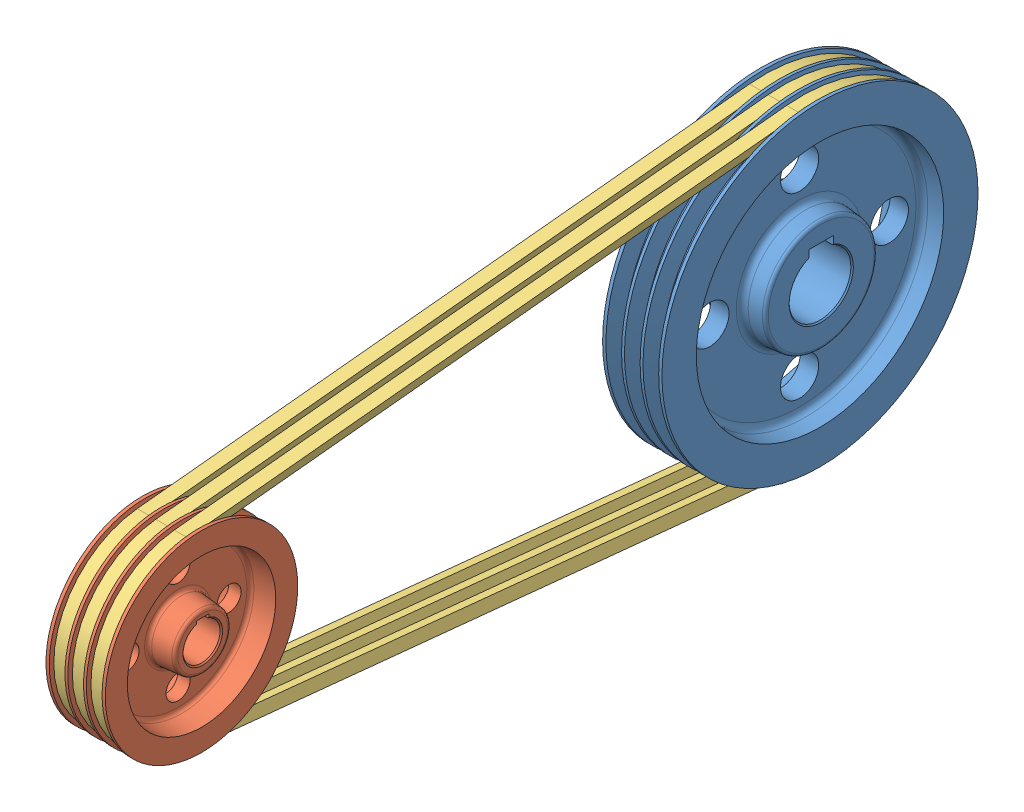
SolidWorks assembly 孔板轮_孔板轮.SLDASM, configuration 默认 (file format 3400). Lengths in mm.
Overall size (50 255.5 705.5).
5 component instances, 3 part files, 6 mates.
Components (placement in the parent):
- 大带轮_孔板轮-1: 大带轮_孔板轮.SLDPRT [A] at (-50.1008 -23.2608 0) size (50 255.5 255.5)
- 小带轮_孔板轮-1: 小带轮_孔板轮.SLDPRT [A] at (-50.1008 -23.2608 500) size (50 155.5 155.5)
- kk_皮带-1: kk_皮带.SLDPRT [默认] at (-41.1008 -23.2608 0) x (1 0 0) z (0 0 -1) size (11 250 700)
- kk_皮带-2: kk_皮带.SLDPRT [默认] at (-26.1008 -23.2608 0) x (1 0 0) z (0 0 -1) size (11 250 700)
- kk_皮带-3: kk_皮带.SLDPRT [默认] at (-11.1008 -23.2608 0) x (1 0 0) z (0 0 -1) size (11 250 700)
Mates (geometry in assembly coordinates):
- 重合1: coincident aligned: plane of ?; plane of ?
- 距离1: distance = 500 mm aligned: plane of ?; plane of ?
- 重合3: coincident aligned: plane of ?; plane of ?
- 同心1: concentric aligned: cylinder of kk_皮带-1
- 重合4: coincident: cone of kk_皮带-1
- 相切1: tangent anti-aligned: unknown of kk_皮带-1
